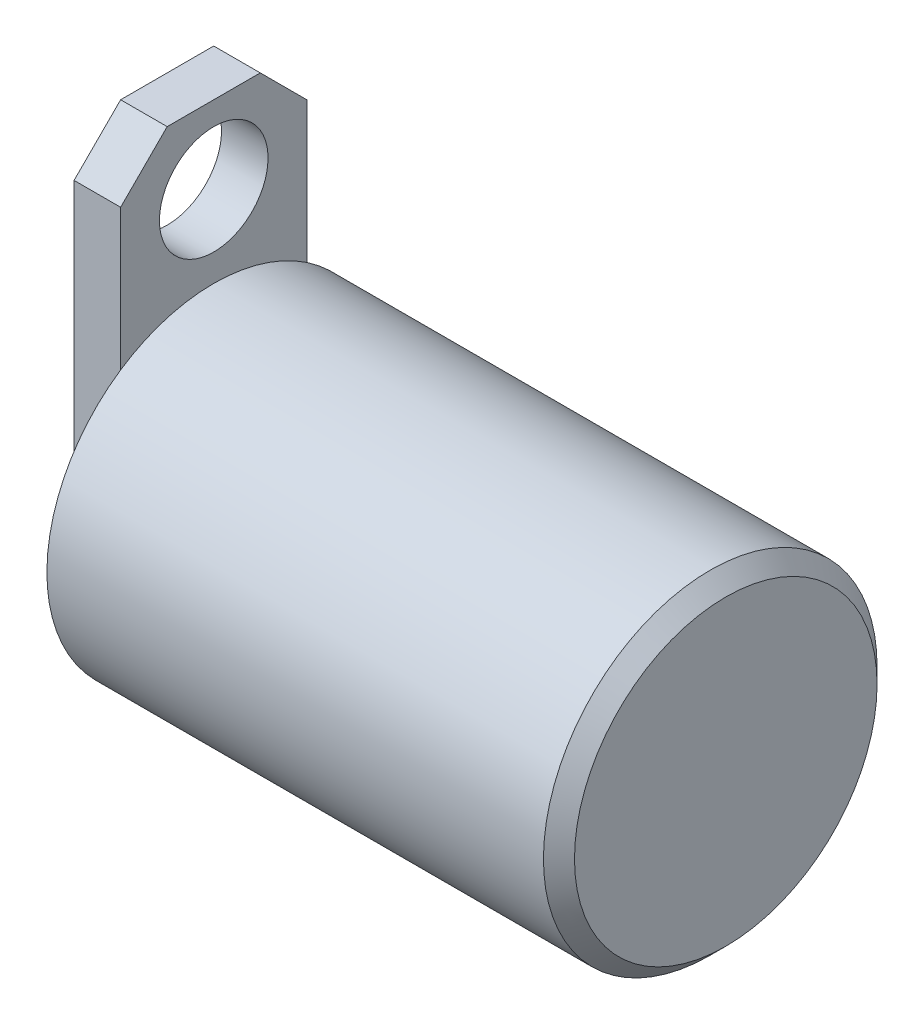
from build123d import *

# Parameters (mm, degrees)
SKETCH1_R           = 10.75
BOSS_EXTRUDE1_DEPTH = 33
SKETCH2_R           = 3.5
BOSS_EXTRUDE2_DEPTH = 3
CHAMFER1_SIZE       = 3
CHAMFER2_SIZE       = 1


with BuildPart() as part:
    # Sketch1 → Boss-Extrude1 (new body)
    with BuildSketch(Plane(origin=(0, 0, 0), x_dir=(0, 0, -1), z_dir=(1, 0, 0))):
        Circle(SKETCH1_R)
    extrude(amount=BOSS_EXTRUDE1_DEPTH)

    # Sketch2 → Boss-Extrude2 (add)
    with BuildSketch(Plane.ZY):
        Polygon((0, 0), (6, 0), (6, 21), (-6, 21), (-6, 0), align=None)
        with Locations((0, 16)):
            Circle(SKETCH2_R, mode=Mode.SUBTRACT)
    extrude(amount=BOSS_EXTRUDE2_DEPTH)

    # Chamfer1
    chamfer1_edges = [part.edges().sort_by_distance(p)[0] for p in [
        (-1.5, 21, 6),
        (-1.5, 21, -6),
    ]]
    chamfer(chamfer1_edges, length=CHAMFER1_SIZE)

    # Chamfer2
    chamfer2_edges = [part.edges().sort_by_distance(p)[0] for p in [
        (33, 0, 10.75),
    ]]
    chamfer(chamfer2_edges, length=CHAMFER2_SIZE)


solid = part.part
